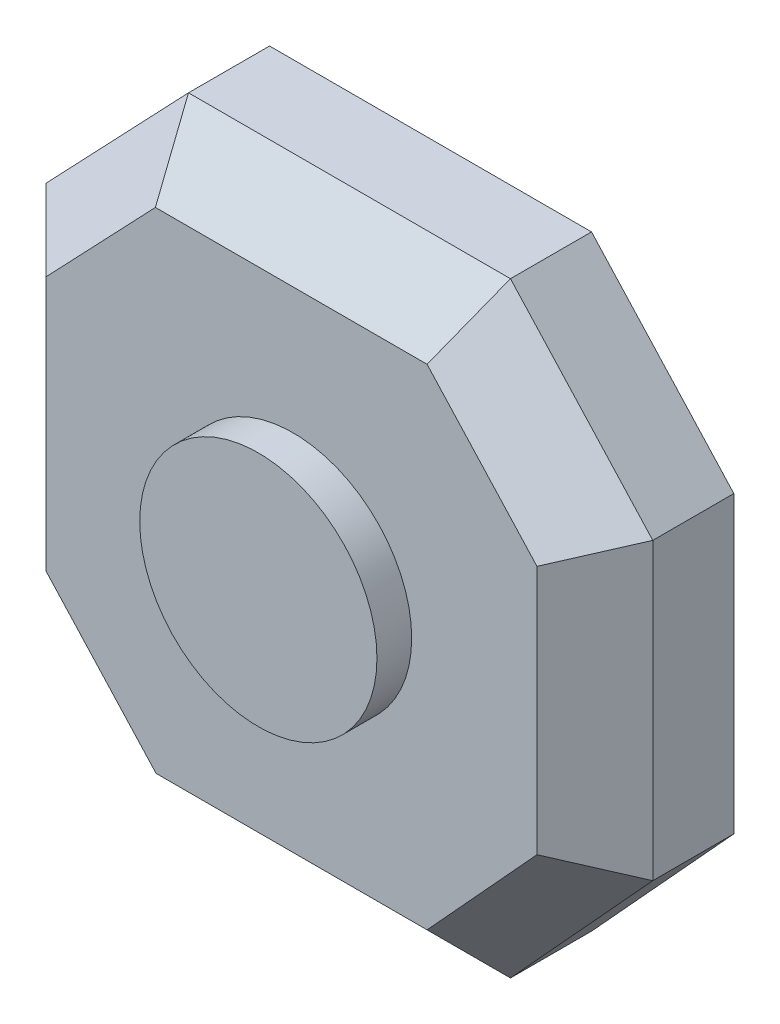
ISO-10303-21;
HEADER;
FILE_DESCRIPTION(('STEP AP214'),'2;1');
FILE_NAME('part.step','',(''),(''),'','','');
FILE_SCHEMA(('AUTOMOTIVE_DESIGN { 1 0 10303 214 1 1 1 1 }'));
ENDSEC;
DATA;
#1=APPLICATION_CONTEXT('core data for automotive mechanical design processes');
#2=APPLICATION_PROTOCOL_DEFINITION('international standard','automotive_design',2000,#1);
#3=PRODUCT_CONTEXT('',#1,'mechanical');
#4=PRODUCT('Part','Part','',(#3));
#5=PRODUCT_RELATED_PRODUCT_CATEGORY('part','',(#4));
#6=PRODUCT_DEFINITION_FORMATION('','',#4);
#7=PRODUCT_DEFINITION_CONTEXT('part definition',#1,'design');
#8=PRODUCT_DEFINITION('design','',#6,#7);
#9=PRODUCT_DEFINITION_SHAPE('','',#8);
#10=(LENGTH_UNIT() NAMED_UNIT(*) SI_UNIT(.MILLI.,.METRE.));
#11=(NAMED_UNIT(*) PLANE_ANGLE_UNIT() SI_UNIT($,.RADIAN.));
#12=(NAMED_UNIT(*) SI_UNIT($,.STERADIAN.) SOLID_ANGLE_UNIT());
#13=UNCERTAINTY_MEASURE_WITH_UNIT(LENGTH_MEASURE(1.E-05),#10,'distance_accuracy_value','');
#14=(GEOMETRIC_REPRESENTATION_CONTEXT(3) GLOBAL_UNCERTAINTY_ASSIGNED_CONTEXT((#13)) GLOBAL_UNIT_ASSIGNED_CONTEXT((#10,
#11,#12)) REPRESENTATION_CONTEXT('',''));
#15=CARTESIAN_POINT('',(0.,0.,0.));
#16=DIRECTION('',(0.,0.,1.));
#17=DIRECTION('',(1.,0.,0.));
#18=AXIS2_PLACEMENT_3D('',#15,#16,#17);
#19=CARTESIAN_POINT('',(0.,0.,1.2));
#20=DIRECTION('',(0.,0.,-1.));
#21=DIRECTION('',(-1.,0.,0.));
#22=AXIS2_PLACEMENT_3D('',#19,#20,#21);
#23=PLANE('',#22);
#24=DIRECTION('',(0.,-1.,0.));
#25=VECTOR('',#24,1.);
#26=CARTESIAN_POINT('',(-2.13222152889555,0.,1.2));
#27=LINE('',#26,#25);
#28=CARTESIAN_POINT('',(-2.13222152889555,1.12477780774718,1.2));
#29=VERTEX_POINT('',#28);
#30=CARTESIAN_POINT('',(-2.13222152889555,-1.07820843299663,1.2));
#31=VERTEX_POINT('',#30);
#32=EDGE_CURVE('E127',#29,#31,#27,.T.);
#33=ORIENTED_EDGE('',*,*,#32,.T.);
#34=DIRECTION('',(0.675290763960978,-0.737551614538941,0.));
#35=VECTOR('',#34,1.);
#36=CARTESIAN_POINT('',(-1.69690537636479,-1.553660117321,1.2));
#37=LINE('',#36,#35);
#38=CARTESIAN_POINT('',(-1.18314396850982,-2.11478959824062,1.2));
#39=VERTEX_POINT('',#38);
#40=EDGE_CURVE('E187',#31,#39,#37,.T.);
#41=ORIENTED_EDGE('',*,*,#40,.T.);
#42=DIRECTION('',(1.,0.,0.));
#43=VECTOR('',#42,1.);
#44=CARTESIAN_POINT('',(0.,-2.11478959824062,1.2));
#45=LINE('',#44,#43);
#46=CARTESIAN_POINT('',(1.15699607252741,-2.11478959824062,1.2));
#47=VERTEX_POINT('',#46);
#48=EDGE_CURVE('E185',#39,#47,#45,.T.);
#49=ORIENTED_EDGE('',*,*,#48,.T.);
#50=DIRECTION('',(0.675290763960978,0.737551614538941,0.));
#51=VECTOR('',#50,1.);
#52=CARTESIAN_POINT('',(1.68268138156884,-1.54063684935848,1.2));
#53=LINE('',#52,#51);
#54=CARTESIAN_POINT('',(2.10607363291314,-1.07820843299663,1.2));
#55=VERTEX_POINT('',#54);
#56=EDGE_CURVE('E183',#47,#55,#53,.T.);
#57=ORIENTED_EDGE('',*,*,#56,.T.);
#58=DIRECTION('',(0.,1.,0.));
#59=VECTOR('',#58,1.);
#60=CARTESIAN_POINT('',(2.10607363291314,0.,1.2));
#61=LINE('',#60,#59);
#62=CARTESIAN_POINT('',(2.10607363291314,1.07820843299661,1.2));
#63=VERTEX_POINT('',#62);
#64=EDGE_CURVE('E181',#55,#63,#61,.T.);
#65=ORIENTED_EDGE('',*,*,#64,.T.);
#66=DIRECTION('',(-0.675290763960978,0.737551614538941,0.));
#67=VECTOR('',#66,1.);
#68=CARTESIAN_POINT('',(1.68268138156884,1.54063684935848,1.2));
#69=LINE('',#68,#67);
#70=CARTESIAN_POINT('',(1.15699607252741,2.11478959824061,1.2));
#71=VERTEX_POINT('',#70);
#72=EDGE_CURVE('E179',#63,#71,#69,.T.);
#73=ORIENTED_EDGE('',*,*,#72,.T.);
#74=DIRECTION('',(-1.,0.,0.));
#75=VECTOR('',#74,1.);
#76=CARTESIAN_POINT('',(0.,2.11478959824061,1.2));
#77=LINE('',#76,#75);
#78=CARTESIAN_POINT('',(-1.18903462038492,2.11478959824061,1.2));
#79=VERTEX_POINT('',#78);
#80=EDGE_CURVE('E177',#71,#79,#77,.T.);
#81=ORIENTED_EDGE('',*,*,#80,.T.);
#82=DIRECTION('',(-0.68977731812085,-0.724021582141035,0.));
#83=VECTOR('',#82,1.);
#84=CARTESIAN_POINT('',(-1.67945539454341,1.60002169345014,1.2));
#85=LINE('',#84,#83);
#86=EDGE_CURVE('E175',#79,#29,#85,.T.);
#87=ORIENTED_EDGE('',*,*,#86,.T.);
#88=EDGE_LOOP('',(#33,#41,#49,#57,#65,#73,#81,#87));
#89=FACE_BOUND('',#88,.T.);
#90=CARTESIAN_POINT('',(0.,0.,1.2));
#91=DIRECTION('',(0.,0.,-1.));
#92=DIRECTION('',(-1.,0.,0.));
#93=AXIS2_PLACEMENT_3D('',#90,#91,#92);
#94=CIRCLE('',#93,1.0241817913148);
#95=CARTESIAN_POINT('',(-1.0241817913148,0.,1.2));
#96=VERTEX_POINT('',#95);
#97=EDGE_CURVE('E11',#96,#96,#94,.F.);
#98=ORIENTED_EDGE('',*,*,#97,.F.);
#99=EDGE_LOOP('',(#98));
#100=FACE_BOUND('',#99,.T.);
#101=ADVANCED_FACE('F32',(#89,#100),#23,.F.);
#102=CARTESIAN_POINT('',(-2.63222152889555,1.32482672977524,1.2));
#103=DIRECTION('',(0.724021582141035,-0.68977731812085,0.));
#104=DIRECTION('',(0.68977731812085,0.724021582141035,0.));
#105=AXIS2_PLACEMENT_3D('',#102,#103,#104);
#106=PLANE('',#105);
#107=DIRECTION('',(0.,0.,-1.));
#108=VECTOR('',#107,1.);
#109=CARTESIAN_POINT('',(-2.63222152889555,1.32482672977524,1.2));
#110=LINE('',#109,#108);
#111=CARTESIAN_POINT('',(-2.63222152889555,1.32482672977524,0.699999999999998));
#112=VERTEX_POINT('',#111);
#113=CARTESIAN_POINT('',(-2.63222152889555,1.32482672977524,0.));
#114=VERTEX_POINT('',#113);
#115=EDGE_CURVE('E121',#112,#114,#110,.T.);
#116=ORIENTED_EDGE('',*,*,#115,.F.);
#117=DIRECTION('',(0.68977731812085,0.724021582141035,0.));
#118=VECTOR('',#117,1.);
#119=CARTESIAN_POINT('',(-2.63222152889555,1.32482672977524,0.699999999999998));
#120=LINE('',#119,#118);
#121=CARTESIAN_POINT('',(-1.40327041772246,2.61478959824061,0.699999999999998));
#122=VERTEX_POINT('',#121);
#123=EDGE_CURVE('E55',#112,#122,#120,.T.);
#124=ORIENTED_EDGE('',*,*,#123,.T.);
#125=DIRECTION('',(0.,0.,-1.));
#126=VECTOR('',#125,1.);
#127=CARTESIAN_POINT('',(-1.40327041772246,2.61478959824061,1.2));
#128=LINE('',#127,#126);
#129=CARTESIAN_POINT('',(-1.40327041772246,2.61478959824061,0.));
#130=VERTEX_POINT('',#129);
#131=EDGE_CURVE('E140',#122,#130,#128,.T.);
#132=ORIENTED_EDGE('',*,*,#131,.T.);
#133=DIRECTION('',(-0.68977731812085,-0.724021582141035,0.));
#134=VECTOR('',#133,1.);
#135=CARTESIAN_POINT('',(-2.63222152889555,1.32482672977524,0.));
#136=LINE('',#135,#134);
#137=EDGE_CURVE('E134',#130,#114,#136,.T.);
#138=ORIENTED_EDGE('',*,*,#137,.T.);
#139=EDGE_LOOP('',(#116,#124,#132,#138));
#140=FACE_BOUND('',#139,.T.);
#141=ADVANCED_FACE('F139',(#140),#106,.F.);
#142=CARTESIAN_POINT('',(-2.63222152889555,-1.27253093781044,1.2));
#143=DIRECTION('',(1.,0.,0.));
#144=DIRECTION('',(0.,0.,-1.));
#145=AXIS2_PLACEMENT_3D('',#142,#143,#144);
#146=PLANE('',#145);
#147=DIRECTION('',(0.,0.,-1.));
#148=VECTOR('',#147,1.);
#149=CARTESIAN_POINT('',(-2.63222152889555,-1.27253093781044,1.2));
#150=LINE('',#149,#148);
#151=CARTESIAN_POINT('',(-2.63222152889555,-1.27253093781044,0.699999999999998));
#152=VERTEX_POINT('',#151);
#153=CARTESIAN_POINT('',(-2.63222152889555,-1.27253093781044,0.));
#154=VERTEX_POINT('',#153);
#155=EDGE_CURVE('E128',#152,#154,#150,.T.);
#156=ORIENTED_EDGE('',*,*,#155,.F.);
#157=DIRECTION('',(0.,1.,0.));
#158=VECTOR('',#157,1.);
#159=CARTESIAN_POINT('',(-2.63222152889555,-1.27253093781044,0.699999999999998));
#160=LINE('',#159,#158);
#161=EDGE_CURVE('E41',#152,#112,#160,.T.);
#162=ORIENTED_EDGE('',*,*,#161,.T.);
#163=ORIENTED_EDGE('',*,*,#115,.T.);
#164=DIRECTION('',(0.,-1.,0.));
#165=VECTOR('',#164,1.);
#166=CARTESIAN_POINT('',(-2.63222152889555,-1.27253093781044,0.));
#167=LINE('',#166,#165);
#168=EDGE_CURVE('E124',#114,#154,#167,.T.);
#169=ORIENTED_EDGE('',*,*,#168,.T.);
#170=EDGE_LOOP('',(#156,#162,#163,#169));
#171=FACE_BOUND('',#170,.T.);
#172=ADVANCED_FACE('F123',(#171),#146,.F.);
#173=CARTESIAN_POINT('',(-1.40327041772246,-2.61478959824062,1.2));
#174=DIRECTION('',(0.737551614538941,0.675290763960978,0.));
#175=DIRECTION('',(-0.675290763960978,0.737551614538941,0.));
#176=AXIS2_PLACEMENT_3D('',#173,#174,#175);
#177=PLANE('',#176);
#178=DIRECTION('',(0.,0.,-1.));
#179=VECTOR('',#178,1.);
#180=CARTESIAN_POINT('',(-1.40327041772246,-2.61478959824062,1.2));
#181=LINE('',#180,#179);
#182=CARTESIAN_POINT('',(-1.40327041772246,-2.61478959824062,0.699999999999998));
#183=VERTEX_POINT('',#182);
#184=CARTESIAN_POINT('',(-1.40327041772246,-2.61478959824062,0.));
#185=VERTEX_POINT('',#184);
#186=EDGE_CURVE('E171',#183,#185,#181,.T.);
#187=ORIENTED_EDGE('',*,*,#186,.F.);
#188=DIRECTION('',(-0.675290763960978,0.737551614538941,0.));
#189=VECTOR('',#188,1.);
#190=CARTESIAN_POINT('',(-1.40327041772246,-2.61478959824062,0.699999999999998));
#191=LINE('',#190,#189);
#192=EDGE_CURVE('E190',#183,#152,#191,.T.);
#193=ORIENTED_EDGE('',*,*,#192,.T.);
#194=ORIENTED_EDGE('',*,*,#155,.T.);
#195=DIRECTION('',(0.675290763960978,-0.737551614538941,0.));
#196=VECTOR('',#195,1.);
#197=CARTESIAN_POINT('',(-1.40327041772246,-2.61478959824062,0.));
#198=LINE('',#197,#196);
#199=EDGE_CURVE('E137',#154,#185,#198,.T.);
#200=ORIENTED_EDGE('',*,*,#199,.T.);
#201=EDGE_LOOP('',(#187,#193,#194,#200));
#202=FACE_BOUND('',#201,.T.);
#203=ADVANCED_FACE('F252',(#202),#177,.F.);
#204=CARTESIAN_POINT('',(1.37712252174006,-2.61478959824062,1.2));
#205=DIRECTION('',(0.,1.,0.));
#206=DIRECTION('',(0.,0.,1.));
#207=AXIS2_PLACEMENT_3D('',#204,#205,#206);
#208=PLANE('',#207);
#209=DIRECTION('',(0.,0.,-1.));
#210=VECTOR('',#209,1.);
#211=CARTESIAN_POINT('',(1.37712252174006,-2.61478959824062,1.2));
#212=LINE('',#211,#210);
#213=CARTESIAN_POINT('',(1.37712252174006,-2.61478959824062,0.699999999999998));
#214=VERTEX_POINT('',#213);
#215=CARTESIAN_POINT('',(1.37712252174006,-2.61478959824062,0.));
#216=VERTEX_POINT('',#215);
#217=EDGE_CURVE('E169',#214,#216,#212,.T.);
#218=ORIENTED_EDGE('',*,*,#217,.F.);
#219=DIRECTION('',(-1.,0.,0.));
#220=VECTOR('',#219,1.);
#221=CARTESIAN_POINT('',(1.37712252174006,-2.61478959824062,0.699999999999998));
#222=LINE('',#221,#220);
#223=EDGE_CURVE('E193',#214,#183,#222,.T.);
#224=ORIENTED_EDGE('',*,*,#223,.T.);
#225=ORIENTED_EDGE('',*,*,#186,.T.);
#226=DIRECTION('',(1.,0.,0.));
#227=VECTOR('',#226,1.);
#228=CARTESIAN_POINT('',(1.37712252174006,-2.61478959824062,0.));
#229=LINE('',#228,#227);
#230=EDGE_CURVE('E148',#185,#216,#229,.T.);
#231=ORIENTED_EDGE('',*,*,#230,.T.);
#232=EDGE_LOOP('',(#218,#224,#225,#231));
#233=FACE_BOUND('',#232,.T.);
#234=ADVANCED_FACE('F249',(#233),#208,.F.);
#235=CARTESIAN_POINT('',(2.60607363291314,-1.27253093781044,1.2));
#236=DIRECTION('',(-0.737551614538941,0.675290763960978,0.));
#237=DIRECTION('',(-0.675290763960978,-0.737551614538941,0.));
#238=AXIS2_PLACEMENT_3D('',#235,#236,#237);
#239=PLANE('',#238);
#240=DIRECTION('',(0.,0.,-1.));
#241=VECTOR('',#240,1.);
#242=CARTESIAN_POINT('',(2.60607363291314,-1.27253093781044,1.2));
#243=LINE('',#242,#241);
#244=CARTESIAN_POINT('',(2.60607363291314,-1.27253093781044,0.699999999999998));
#245=VERTEX_POINT('',#244);
#246=CARTESIAN_POINT('',(2.60607363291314,-1.27253093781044,0.));
#247=VERTEX_POINT('',#246);
#248=EDGE_CURVE('E167',#245,#247,#243,.T.);
#249=ORIENTED_EDGE('',*,*,#248,.F.);
#250=DIRECTION('',(-0.675290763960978,-0.737551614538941,0.));
#251=VECTOR('',#250,1.);
#252=CARTESIAN_POINT('',(2.60607363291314,-1.27253093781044,0.699999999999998));
#253=LINE('',#252,#251);
#254=EDGE_CURVE('E195',#245,#214,#253,.T.);
#255=ORIENTED_EDGE('',*,*,#254,.T.);
#256=ORIENTED_EDGE('',*,*,#217,.T.);
#257=DIRECTION('',(0.675290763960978,0.737551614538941,0.));
#258=VECTOR('',#257,1.);
#259=CARTESIAN_POINT('',(2.60607363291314,-1.27253093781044,0.));
#260=LINE('',#259,#258);
#261=EDGE_CURVE('E151',#216,#247,#260,.T.);
#262=ORIENTED_EDGE('',*,*,#261,.T.);
#263=EDGE_LOOP('',(#249,#255,#256,#262));
#264=FACE_BOUND('',#263,.T.);
#265=ADVANCED_FACE('F280',(#264),#239,.F.);
#266=CARTESIAN_POINT('',(2.60607363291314,1.27253093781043,1.2));
#267=DIRECTION('',(-1.,0.,0.));
#268=DIRECTION('',(0.,0.,1.));
#269=AXIS2_PLACEMENT_3D('',#266,#267,#268);
#270=PLANE('',#269);
#271=DIRECTION('',(0.,0.,-1.));
#272=VECTOR('',#271,1.);
#273=CARTESIAN_POINT('',(2.60607363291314,1.27253093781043,1.2));
#274=LINE('',#273,#272);
#275=CARTESIAN_POINT('',(2.60607363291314,1.27253093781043,0.699999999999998));
#276=VERTEX_POINT('',#275);
#277=CARTESIAN_POINT('',(2.60607363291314,1.27253093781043,0.));
#278=VERTEX_POINT('',#277);
#279=EDGE_CURVE('E165',#276,#278,#274,.T.);
#280=ORIENTED_EDGE('',*,*,#279,.F.);
#281=DIRECTION('',(0.,-1.,0.));
#282=VECTOR('',#281,1.);
#283=CARTESIAN_POINT('',(2.60607363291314,1.27253093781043,0.699999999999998));
#284=LINE('',#283,#282);
#285=EDGE_CURVE('E197',#276,#245,#284,.T.);
#286=ORIENTED_EDGE('',*,*,#285,.T.);
#287=ORIENTED_EDGE('',*,*,#248,.T.);
#288=DIRECTION('',(0.,1.,0.));
#289=VECTOR('',#288,1.);
#290=CARTESIAN_POINT('',(2.60607363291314,1.27253093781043,0.));
#291=LINE('',#290,#289);
#292=EDGE_CURVE('E154',#247,#278,#291,.T.);
#293=ORIENTED_EDGE('',*,*,#292,.T.);
#294=EDGE_LOOP('',(#280,#286,#287,#293));
#295=FACE_BOUND('',#294,.T.);
#296=ADVANCED_FACE('F277',(#295),#270,.F.);
#297=CARTESIAN_POINT('',(1.37712252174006,2.61478959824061,1.2));
#298=DIRECTION('',(-0.737551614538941,-0.675290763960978,0.));
#299=DIRECTION('',(0.675290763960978,-0.737551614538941,0.));
#300=AXIS2_PLACEMENT_3D('',#297,#298,#299);
#301=PLANE('',#300);
#302=DIRECTION('',(0.,0.,-1.));
#303=VECTOR('',#302,1.);
#304=CARTESIAN_POINT('',(1.37712252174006,2.61478959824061,1.2));
#305=LINE('',#304,#303);
#306=CARTESIAN_POINT('',(1.37712252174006,2.61478959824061,0.699999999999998));
#307=VERTEX_POINT('',#306);
#308=CARTESIAN_POINT('',(1.37712252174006,2.61478959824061,0.));
#309=VERTEX_POINT('',#308);
#310=EDGE_CURVE('E163',#307,#309,#305,.T.);
#311=ORIENTED_EDGE('',*,*,#310,.F.);
#312=DIRECTION('',(0.675290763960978,-0.737551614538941,0.));
#313=VECTOR('',#312,1.);
#314=CARTESIAN_POINT('',(1.37712252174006,2.61478959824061,0.699999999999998));
#315=LINE('',#314,#313);
#316=EDGE_CURVE('E199',#307,#276,#315,.T.);
#317=ORIENTED_EDGE('',*,*,#316,.T.);
#318=ORIENTED_EDGE('',*,*,#279,.T.);
#319=DIRECTION('',(-0.675290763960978,0.737551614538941,0.));
#320=VECTOR('',#319,1.);
#321=CARTESIAN_POINT('',(1.37712252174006,2.61478959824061,0.));
#322=LINE('',#321,#320);
#323=EDGE_CURVE('E157',#278,#309,#322,.T.);
#324=ORIENTED_EDGE('',*,*,#323,.T.);
#325=EDGE_LOOP('',(#311,#317,#318,#324));
#326=FACE_BOUND('',#325,.T.);
#327=ADVANCED_FACE('F271',(#326),#301,.F.);
#328=CARTESIAN_POINT('',(-1.40327041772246,2.61478959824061,1.2));
#329=DIRECTION('',(0.,-1.,0.));
#330=DIRECTION('',(0.,0.,-1.));
#331=AXIS2_PLACEMENT_3D('',#328,#329,#330);
#332=PLANE('',#331);
#333=ORIENTED_EDGE('',*,*,#131,.F.);
#334=DIRECTION('',(1.,0.,0.));
#335=VECTOR('',#334,1.);
#336=CARTESIAN_POINT('',(-1.40327041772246,2.61478959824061,0.699999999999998));
#337=LINE('',#336,#335);
#338=EDGE_CURVE('E201',#122,#307,#337,.T.);
#339=ORIENTED_EDGE('',*,*,#338,.T.);
#340=ORIENTED_EDGE('',*,*,#310,.T.);
#341=DIRECTION('',(-1.,0.,0.));
#342=VECTOR('',#341,1.);
#343=CARTESIAN_POINT('',(-1.40327041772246,2.61478959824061,0.));
#344=LINE('',#343,#342);
#345=EDGE_CURVE('E160',#309,#130,#344,.T.);
#346=ORIENTED_EDGE('',*,*,#345,.T.);
#347=EDGE_LOOP('',(#333,#339,#340,#346));
#348=FACE_BOUND('',#347,.T.);
#349=ADVANCED_FACE('F269',(#348),#332,.F.);
#350=CARTESIAN_POINT('',(0.,0.,0.));
#351=DIRECTION('',(0.,0.,-1.));
#352=DIRECTION('',(-1.,0.,0.));
#353=AXIS2_PLACEMENT_3D('',#350,#351,#352);
#354=PLANE('',#353);
#355=ORIENTED_EDGE('',*,*,#137,.F.);
#356=ORIENTED_EDGE('',*,*,#345,.F.);
#357=ORIENTED_EDGE('',*,*,#323,.F.);
#358=ORIENTED_EDGE('',*,*,#292,.F.);
#359=ORIENTED_EDGE('',*,*,#261,.F.);
#360=ORIENTED_EDGE('',*,*,#230,.F.);
#361=ORIENTED_EDGE('',*,*,#199,.F.);
#362=ORIENTED_EDGE('',*,*,#168,.F.);
#363=EDGE_LOOP('',(#355,#356,#357,#358,#359,#360,#361,#362));
#364=FACE_BOUND('',#363,.T.);
#365=ADVANCED_FACE('F132',(#364),#354,.T.);
#366=CARTESIAN_POINT('',(1.68268138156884,1.54063684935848,1.2));
#367=DIRECTION('',(-0.521527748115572,-0.477502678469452,-0.707106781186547));
#368=DIRECTION('',(-0.675290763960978,0.737551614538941,0.));
#369=AXIS2_PLACEMENT_3D('',#366,#367,#368);
#370=PLANE('',#369);
#371=DIRECTION('',(0.681828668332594,0.264989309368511,-0.681828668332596));
#372=VECTOR('',#371,1.);
#373=CARTESIAN_POINT('',(1.9927929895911,1.0341824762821,1.31328064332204));
#374=LINE('',#373,#372);
#375=EDGE_CURVE('E144',#276,#63,#374,.F.);
#376=ORIENTED_EDGE('',*,*,#375,.F.);
#377=ORIENTED_EDGE('',*,*,#316,.F.);
#378=DIRECTION('',(0.297236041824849,0.675148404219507,-0.675148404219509));
#379=VECTOR('',#378,1.);
#380=CARTESIAN_POINT('',(1.05477632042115,1.88260543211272,1.43218416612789));
#381=LINE('',#380,#379);
#382=EDGE_CURVE('E36',#71,#307,#381,.T.);
#383=ORIENTED_EDGE('',*,*,#382,.F.);
#384=ORIENTED_EDGE('',*,*,#72,.F.);
#385=EDGE_LOOP('',(#376,#377,#383,#384));
#386=FACE_BOUND('',#385,.T.);
#387=ADVANCED_FACE('F34',(#386),#370,.F.);
#388=CARTESIAN_POINT('',(0.,2.11478959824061,1.2));
#389=DIRECTION('',(0.,-0.707106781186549,-0.707106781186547));
#390=DIRECTION('',(-1.,0.,0.));
#391=AXIS2_PLACEMENT_3D('',#388,#389,#390);
#392=PLANE('',#391);
#393=ORIENTED_EDGE('',*,*,#382,.T.);
#394=ORIENTED_EDGE('',*,*,#338,.F.);
#395=DIRECTION('',(-0.289959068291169,0.676728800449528,-0.67672880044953));
#396=VECTOR('',#395,1.);
#397=CARTESIAN_POINT('',(-1.129257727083,1.97527768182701,1.3395119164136));
#398=LINE('',#397,#396);
#399=EDGE_CURVE('E219',#79,#122,#398,.T.);
#400=ORIENTED_EDGE('',*,*,#399,.F.);
#401=ORIENTED_EDGE('',*,*,#80,.F.);
#402=EDGE_LOOP('',(#393,#394,#400,#401));
#403=FACE_BOUND('',#402,.T.);
#404=ADVANCED_FACE('F266',(#403),#392,.F.);
#405=CARTESIAN_POINT('',(2.10607363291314,0.,1.2));
#406=DIRECTION('',(-0.707106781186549,0.,-0.707106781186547));
#407=DIRECTION('',(0.,1.,0.));
#408=AXIS2_PLACEMENT_3D('',#405,#406,#407);
#409=PLANE('',#408);
#410=ORIENTED_EDGE('',*,*,#375,.T.);
#411=ORIENTED_EDGE('',*,*,#64,.F.);
#412=DIRECTION('',(0.681828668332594,-0.264989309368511,-0.681828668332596));
#413=VECTOR('',#412,1.);
#414=CARTESIAN_POINT('',(1.91126583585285,-1.00249735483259,1.39480779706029));
#415=LINE('',#414,#413);
#416=EDGE_CURVE('E216',#245,#55,#415,.F.);
#417=ORIENTED_EDGE('',*,*,#416,.F.);
#418=ORIENTED_EDGE('',*,*,#285,.F.);
#419=EDGE_LOOP('',(#410,#411,#417,#418));
#420=FACE_BOUND('',#419,.T.);
#421=ADVANCED_FACE('F226',(#420),#409,.F.);
#422=CARTESIAN_POINT('',(-1.67945539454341,1.60002169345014,1.2));
#423=DIRECTION('',(0.511960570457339,-0.487746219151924,-0.707106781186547));
#424=DIRECTION('',(-0.68977731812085,-0.724021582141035,0.));
#425=AXIS2_PLACEMENT_3D('',#422,#423,#424);
#426=PLANE('',#425);
#427=ORIENTED_EDGE('',*,*,#399,.T.);
#428=ORIENTED_EDGE('',*,*,#123,.F.);
#429=DIRECTION('',(-0.680401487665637,0.272227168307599,-0.680401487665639));
#430=VECTOR('',#429,1.);
#431=CARTESIAN_POINT('',(-1.92388594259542,1.04142318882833,1.40833558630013));
#432=LINE('',#431,#430);
#433=EDGE_CURVE('E213',#29,#112,#432,.T.);
#434=ORIENTED_EDGE('',*,*,#433,.F.);
#435=ORIENTED_EDGE('',*,*,#86,.F.);
#436=EDGE_LOOP('',(#427,#428,#434,#435));
#437=FACE_BOUND('',#436,.T.);
#438=ADVANCED_FACE('F263',(#437),#426,.F.);
#439=CARTESIAN_POINT('',(1.68268138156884,-1.54063684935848,1.2));
#440=DIRECTION('',(-0.521527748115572,0.477502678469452,-0.707106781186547));
#441=DIRECTION('',(0.675290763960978,0.737551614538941,0.));
#442=AXIS2_PLACEMENT_3D('',#439,#440,#441);
#443=PLANE('',#442);
#444=ORIENTED_EDGE('',*,*,#416,.T.);
#445=ORIENTED_EDGE('',*,*,#56,.F.);
#446=DIRECTION('',(0.297236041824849,-0.675148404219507,-0.675148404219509));
#447=VECTOR('',#446,1.);
#448=CARTESIAN_POINT('',(1.08821990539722,-1.95856991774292,1.3562196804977));
#449=LINE('',#448,#447);
#450=EDGE_CURVE('E210',#214,#47,#449,.F.);
#451=ORIENTED_EDGE('',*,*,#450,.F.);
#452=ORIENTED_EDGE('',*,*,#254,.F.);
#453=EDGE_LOOP('',(#444,#445,#451,#452));
#454=FACE_BOUND('',#453,.T.);
#455=ADVANCED_FACE('F240',(#454),#443,.F.);
#456=CARTESIAN_POINT('',(-2.13222152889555,0.,1.2));
#457=DIRECTION('',(0.707106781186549,0.,-0.707106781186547));
#458=DIRECTION('',(0.,-1.,0.));
#459=AXIS2_PLACEMENT_3D('',#456,#457,#458);
#460=PLANE('',#459);
#461=ORIENTED_EDGE('',*,*,#433,.T.);
#462=ORIENTED_EDGE('',*,*,#161,.F.);
#463=DIRECTION('',(0.681828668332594,0.26498930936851,0.681828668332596));
#464=VECTOR('',#463,1.);
#465=CARTESIAN_POINT('',(-1.93741373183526,-1.00249735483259,1.39480779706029));
#466=LINE('',#465,#464);
#467=EDGE_CURVE('E207',#31,#152,#466,.F.);
#468=ORIENTED_EDGE('',*,*,#467,.F.);
#469=ORIENTED_EDGE('',*,*,#32,.F.);
#470=EDGE_LOOP('',(#461,#462,#468,#469));
#471=FACE_BOUND('',#470,.T.);
#472=ADVANCED_FACE('F259',(#471),#460,.F.);
#473=CARTESIAN_POINT('',(0.,-2.11478959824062,1.2));
#474=DIRECTION('',(0.,0.707106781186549,-0.707106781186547));
#475=DIRECTION('',(1.,0.,0.));
#476=AXIS2_PLACEMENT_3D('',#473,#474,#475);
#477=PLANE('',#476);
#478=ORIENTED_EDGE('',*,*,#450,.T.);
#479=ORIENTED_EDGE('',*,*,#48,.F.);
#480=DIRECTION('',(-0.297236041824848,-0.675148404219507,-0.675148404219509));
#481=VECTOR('',#480,1.);
#482=CARTESIAN_POINT('',(-1.07861406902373,-1.87735811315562,1.437431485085));
#483=LINE('',#482,#481);
#484=EDGE_CURVE('E205',#183,#39,#483,.F.);
#485=ORIENTED_EDGE('',*,*,#484,.F.);
#486=ORIENTED_EDGE('',*,*,#223,.F.);
#487=EDGE_LOOP('',(#478,#479,#485,#486));
#488=FACE_BOUND('',#487,.T.);
#489=ADVANCED_FACE('F244',(#488),#477,.F.);
#490=CARTESIAN_POINT('',(-1.69690537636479,-1.553660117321,1.2));
#491=DIRECTION('',(0.521527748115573,0.477502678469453,-0.707106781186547));
#492=DIRECTION('',(0.675290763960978,-0.737551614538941,0.));
#493=AXIS2_PLACEMENT_3D('',#490,#491,#492);
#494=PLANE('',#493);
#495=ORIENTED_EDGE('',*,*,#467,.T.);
#496=ORIENTED_EDGE('',*,*,#192,.F.);
#497=ORIENTED_EDGE('',*,*,#484,.T.);
#498=ORIENTED_EDGE('',*,*,#40,.F.);
#499=EDGE_LOOP('',(#495,#496,#497,#498));
#500=FACE_BOUND('',#499,.T.);
#501=ADVANCED_FACE('F254',(#500),#494,.F.);
#502=CARTESIAN_POINT('',(0.,0.,1.5));
#503=DIRECTION('',(0.,0.,-1.));
#504=DIRECTION('',(-1.,0.,0.));
#505=AXIS2_PLACEMENT_3D('',#502,#503,#504);
#506=CYLINDRICAL_SURFACE('',#505,1.0241817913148);
#507=CARTESIAN_POINT('',(0.,0.,1.5));
#508=DIRECTION('',(0.,0.,1.));
#509=DIRECTION('',(1.,0.,0.));
#510=AXIS2_PLACEMENT_3D('',#507,#508,#509);
#511=CIRCLE('',#510,1.0241817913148);
#512=CARTESIAN_POINT('',(1.0241817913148,0.,1.5));
#513=VERTEX_POINT('',#512);
#514=EDGE_CURVE('E208',#513,#513,#511,.T.);
#515=ORIENTED_EDGE('',*,*,#514,.F.);
#516=EDGE_LOOP('',(#515));
#517=FACE_BOUND('',#516,.T.);
#518=ORIENTED_EDGE('',*,*,#97,.T.);
#519=EDGE_LOOP('',(#518));
#520=FACE_BOUND('',#519,.T.);
#521=ADVANCED_FACE('F297',(#517,#520),#506,.T.);
#522=CARTESIAN_POINT('',(0.,0.,1.5));
#523=DIRECTION('',(0.,0.,1.));
#524=DIRECTION('',(1.,0.,0.));
#525=AXIS2_PLACEMENT_3D('',#522,#523,#524);
#526=PLANE('',#525);
#527=ORIENTED_EDGE('',*,*,#514,.T.);
#528=EDGE_LOOP('',(#527));
#529=FACE_BOUND('',#528,.T.);
#530=ADVANCED_FACE('F368',(#529),#526,.T.);
#531=CLOSED_SHELL('',(#101,#141,#172,#203,#234,#265,#296,#327,#349,#365,#387,#404,#421,#438,
#455,#472,#489,#501,#521,#530));
#532=MANIFOLD_SOLID_BREP('B2',#531);
#533=ADVANCED_BREP_SHAPE_REPRESENTATION('',(#18,#532),#14);
#534=SHAPE_DEFINITION_REPRESENTATION(#9,#533);
ENDSEC;
END-ISO-10303-21;
